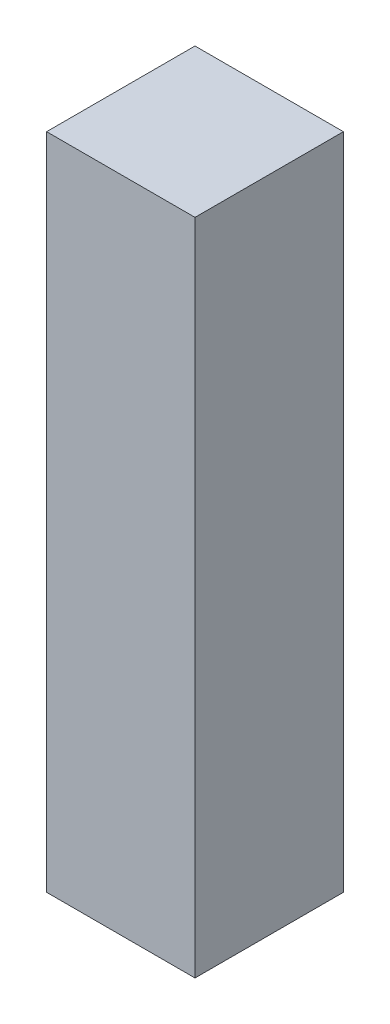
from build123d import *

# Parameters (mm, degrees)
SKETCH1_W           = 6.532928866
SKETCH1_H           = 6.532928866
BOSS_EXTRUDE1_DEPTH = 29


with BuildPart() as part:
    # Sketch1 → Boss-Extrude1 (new body)
    with BuildSketch(Plane(origin=(0, 0, 0), x_dir=(1, 0, 0), z_dir=(0, 1, 0))):
        Rectangle(SKETCH1_W, SKETCH1_H)
    extrude(amount=BOSS_EXTRUDE1_DEPTH)


solid = part.part
